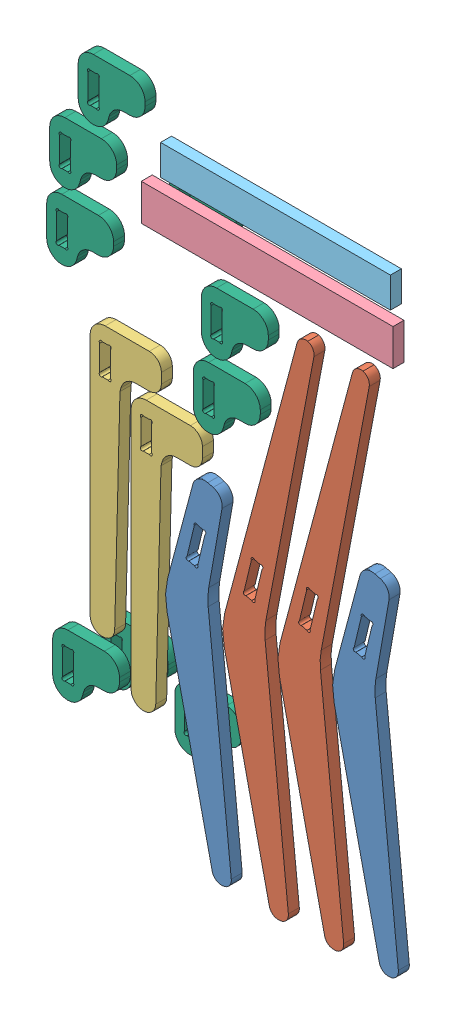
SolidWorks assembly Assemblage2.SLDASM, configuration Défaut (file format 10000). Lengths in mm.
Overall size (640.13 1080.45 169.83).
17 component instances, 6 part files, 13 mates.
Components (placement in the parent):
- Pièce2-1: Pièce2.SLDPRT [Défaut] at (-133.0139 112.8057 137.6202) size (108.21 562.72 18)
- Pièce3-1: Pièce3.SLDPRT [Défaut] at (-39.1331 110.3231 137.6202) size (150.41 848.49 18)
- Pièce3-2: Pièce3.SLDPRT [Défaut] at (51.8576 113.3662 137.6202) size (150.41 848.49 18)
- Pièce2-2: Pièce2.SLDPRT [Défaut] at (141.79 120.2957 137.6202) size (108.21 562.72 18)
- Pièce7-1: Pièce7.SLDPRT [Défaut] at (-45.305 239.6959 137.6202) size (117.39 444.9 18)
- Pièce7-2: Pièce7.SLDPRT [Défaut] at (-112.8348 311.7017 137.6202) size (117.39 444.9 18)
- Pièce9-1: Pièce9.SLDPRT [Défaut] at (178.4435 567.3861 137.6202) size (414 60 18)
- Pièce8-1: Pièce8.SLDPRT [Défaut] at (192.1963 643.5963 137.6202) size (378 50 18)
- Pièce4-1: Pièce4.SLDPRT [Défaut] at (-245.8139 -246.0355 -13.7909) size (600 1100 18)
- Pièce4-2: Pièce4.SLDPRT [Défaut] at (-114.3078 -270.5143 -3.1961) size (600 1100 18)
- Pièce4-3: Pièce4.SLDPRT [Défaut] at (-174.4068 -152.4192 137.6202) size (600 1100 18)
- Pièce4-4: Pièce4.SLDPRT [Défaut] at (-132.3848 688.6443 137.6202) size (600 1100 18)
- Pièce4-5: Pièce4.SLDPRT [Défaut] at (-184.164 463.5071 137.6202) size (600 1100 18)
- Pièce4-6: Pièce4.SLDPRT [Défaut] at (70.3302 457.2436 137.6202) size (600 1100 18)
- Pièce4-7: Pièce4.SLDPRT [Défaut] at (-134.4142 446.3958 -14.2109) size (600 1100 18)
- Pièce4-8: Pièce4.SLDPRT [Défaut] at (-179.1807 575.2394 137.6202) size (600 1100 18)
- Pièce4-9: Pièce4.SLDPRT [Défaut] at (57.1006 344.6261 137.6202) size (600 1100 18)
Mates (geometry in assembly coordinates):
- Coïncidente1: coincident aligned: plane of Pièce3-1 through (-39.1331 110.3231 155.6202) normal (0 0 1); plane of Pièce3-2 through (51.8576 113.3662 155.6202) normal (0 0 1)
- Coïncidente2: coincident aligned: plane of Pièce2-1 through (-133.0139 112.8057 155.6202) normal (0 0 1); plane of Pièce3-1 through (-39.1331 110.3231 155.6202) normal (0 0 1)
- Coïncidente3: coincident aligned: plane of Pièce3-2 through (51.8576 113.3662 155.6202) normal (0 0 1); plane of Pièce2-2 through (141.79 120.2957 155.6202) normal (0 0 1)
- Coïncidente4: coincident aligned: plane of Pièce2-1 through (-133.0139 112.8057 155.6202) normal (0 0 1); plane of Pièce7-1 through (-45.305 239.6959 155.6202) normal (0 0 1)
- Coïncidente5: coincident aligned: plane of Pièce7-1 through (-45.305 239.6959 155.6202) normal (0 0 1); plane of Pièce7-2 through (-112.8348 311.7017 155.6202) normal (0 0 1)
- Coïncidente6: coincident aligned: plane of Pièce3-1 through (-39.1331 110.3231 155.6202) normal (0 0 1); plane of Pièce8-1 through (192.1963 643.5963 155.6202) normal (0 0 1)
- Coïncidente7: coincident aligned: plane of Pièce3-2 through (51.8576 113.3662 155.6202) normal (0 0 1); plane of Pièce9-1 through (178.4435 567.3861 155.6202) normal (0 0 1)
- Coïncidente8: coincident aligned: plane of Pièce8-1 through (192.1963 643.5963 155.6202) normal (0 0 1); plane of Pièce4-8 through (-154.2807 550.1394 155.6202) normal (0 0 1)
- Coïncidente9: coincident aligned: plane of Pièce4-9 through (82.0006 319.5261 155.6202) normal (0 0 1); plane of Pièce7-2 through (-112.8348 311.7017 155.6202) normal (0 0 1)
- Coïncidente10: coincident aligned: plane of Pièce9-1 through (178.4435 567.3861 155.6202) normal (0 0 1); plane of Pièce4-6 through (95.2302 432.1436 155.6202) normal (0 0 1)
- Coïncidente11: coincident aligned: plane of Pièce9-1 through (178.4435 567.3861 155.6202) normal (0 0 1); plane of Pièce4-3 through (-149.5068 -177.5192 155.6202) normal (0 0 1)
- Coïncidente12: coincident aligned: plane of Pièce7-1 through (-45.305 239.6959 155.6202) normal (0 0 1); plane of Pièce4-5 through (-159.264 438.4071 155.6202) normal (0 0 1)
- Coïncidente13: coincident aligned: plane of Pièce2-1 through (-133.0139 112.8057 155.6202) normal (0 0 1); plane of Pièce4-4 through (-107.4848 663.5443 155.6202) normal (0 0 1)
